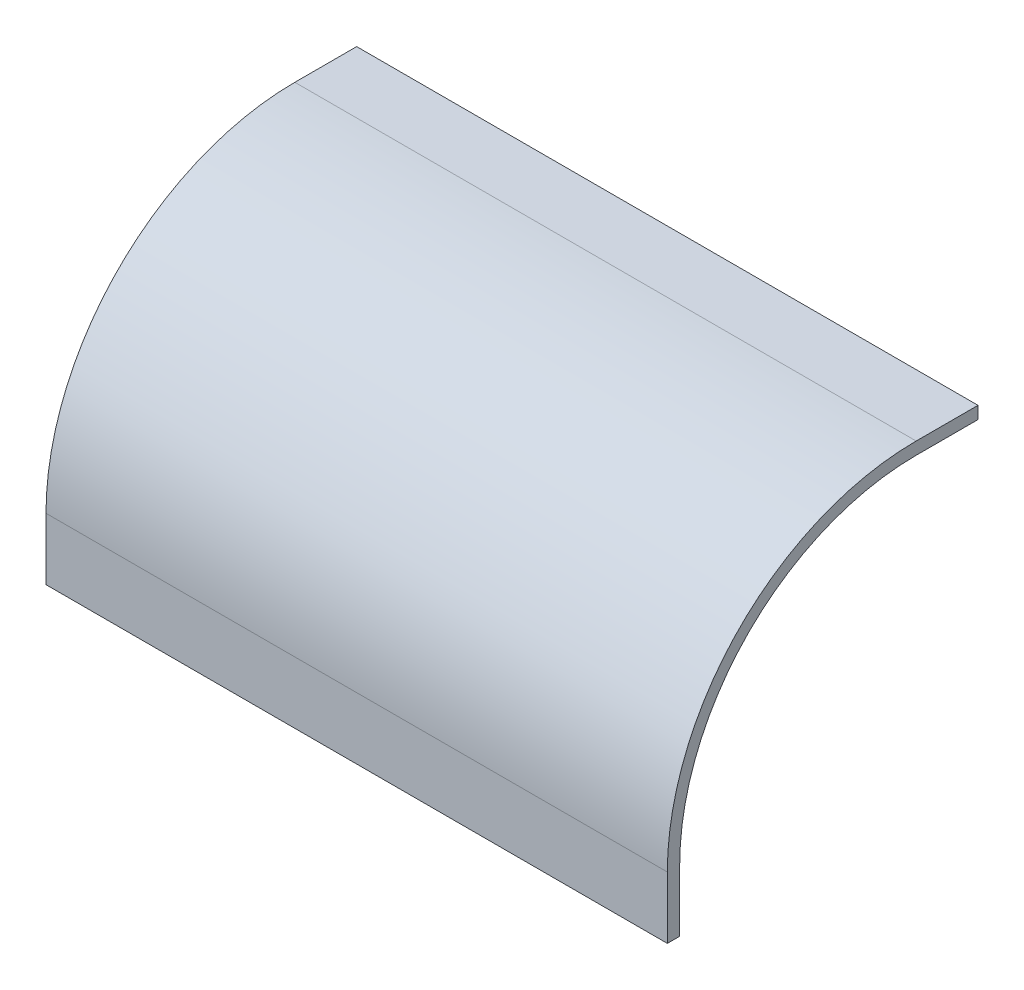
from build123d import *


with BuildPart() as part:
    # Sweep1: sweep along a path in Sketch1
    with BuildLine(Plane(origin=(0, 0, 0), x_dir=(0, 0, -1), z_dir=(1, 0, 0))) as sweep1_path:
        Line((0, 0), (0, 50))
        ThreePointArc((0, 50), (58.578643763, 191.421356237), (200, 250))
        Line((200, 250), (250, 250))
    # Sketch2 → Sweep1 (sweep)
    with BuildSketch(Plane(origin=(0, 0, 0), x_dir=(1, 0, 0), z_dir=(0, 1, 0))):
        Polygon((0, 0), (-500, 0), (-500, 8.786), (-501.214, 8.786), (-501.214, -1.214), (1.214, -1.214), (1.214, 8.786), (0, 8.786), align=None)
    sweep(path=sweep1_path.line)


solid = part.part
